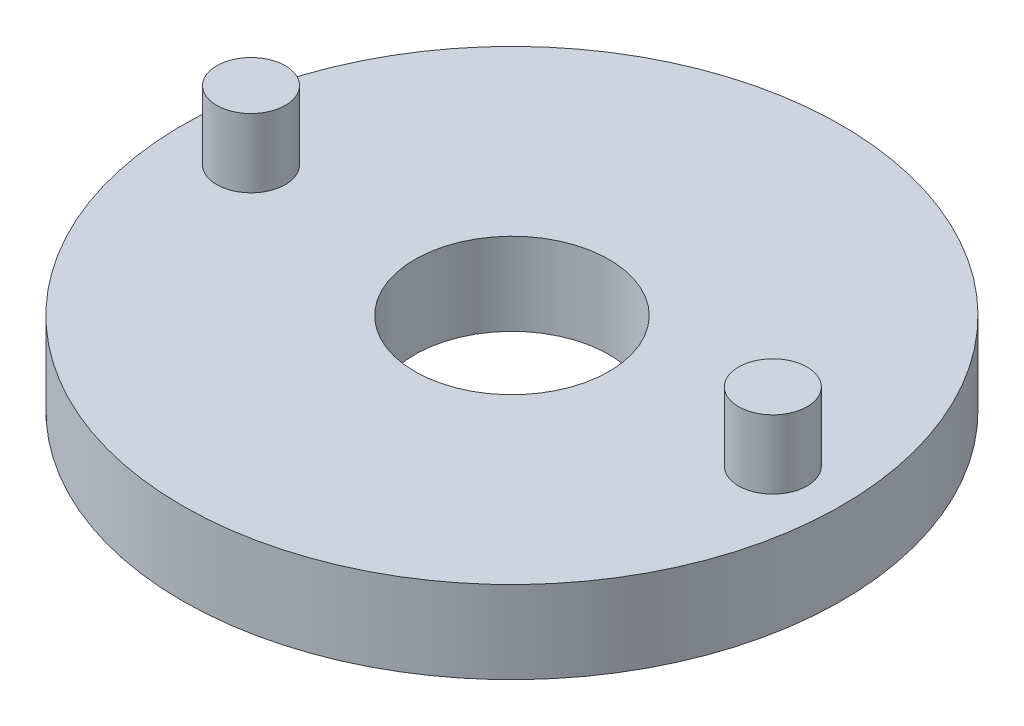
from build123d import *

# Parameters (mm, degrees)
SKETCH1_R           = 24
BOSS_EXTRUDE1_DEPTH = 6
SKETCH3_R           = 7.071067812
CUT_EXTRUDE2_DEPTH  = 6
SKETCH12_R          = 2.5
BOSS_EXTRUDE2_DEPTH = 5
SKETCH13_R          = 21
SKETCH13_R_2        = 10.5
CUT_EXTRUDE3_DEPTH  = 4


with BuildPart() as part:
    # Sketch1 → Boss-Extrude1 (new body)
    with BuildSketch(Plane(origin=(0, 0, 0), x_dir=(1, 0, 0), z_dir=(0, 1, 0))):
        with Locations(Location((0, 0, 0), (0, 0, 270))):
            Circle(SKETCH1_R)
    extrude(amount=BOSS_EXTRUDE1_DEPTH)

    # Sketch3 → Cut-Extrude2 (cut)
    with BuildSketch(Plane(origin=(0, 6, 0), x_dir=(1, 0, 0), z_dir=(0, 1, 0))):
        with Locations(Location((0, 0, 0), (0, 0, 270))):
            Circle(SKETCH3_R)
    extrude(amount=-CUT_EXTRUDE2_DEPTH, mode=Mode.SUBTRACT)

    # Sketch12 → Boss-Extrude2 (add)
    with BuildSketch(Plane(origin=(0, 6, 0), x_dir=(1, 0, 0), z_dir=(0, 1, 0))):
        with Locations(Location((-19, 0, 0), (0, 0, 270))):
            Circle(SKETCH12_R)
        with Locations(Location((19, 0, 0), (0, 0, 270))):
            Circle(SKETCH12_R)
    extrude(amount=BOSS_EXTRUDE2_DEPTH)

    # Sketch13 → Cut-Extrude3 (cut)
    with BuildSketch(Plane.XZ):
        with Locations(Location((0, 0, 0), (0, 0, 270))):
            Circle(SKETCH13_R)
        with Locations(Location((0, 0, 0), (0, 0, 270))):
            Circle(SKETCH13_R_2, mode=Mode.SUBTRACT)
    extrude(amount=-CUT_EXTRUDE3_DEPTH, mode=Mode.SUBTRACT)


solid = part.part
